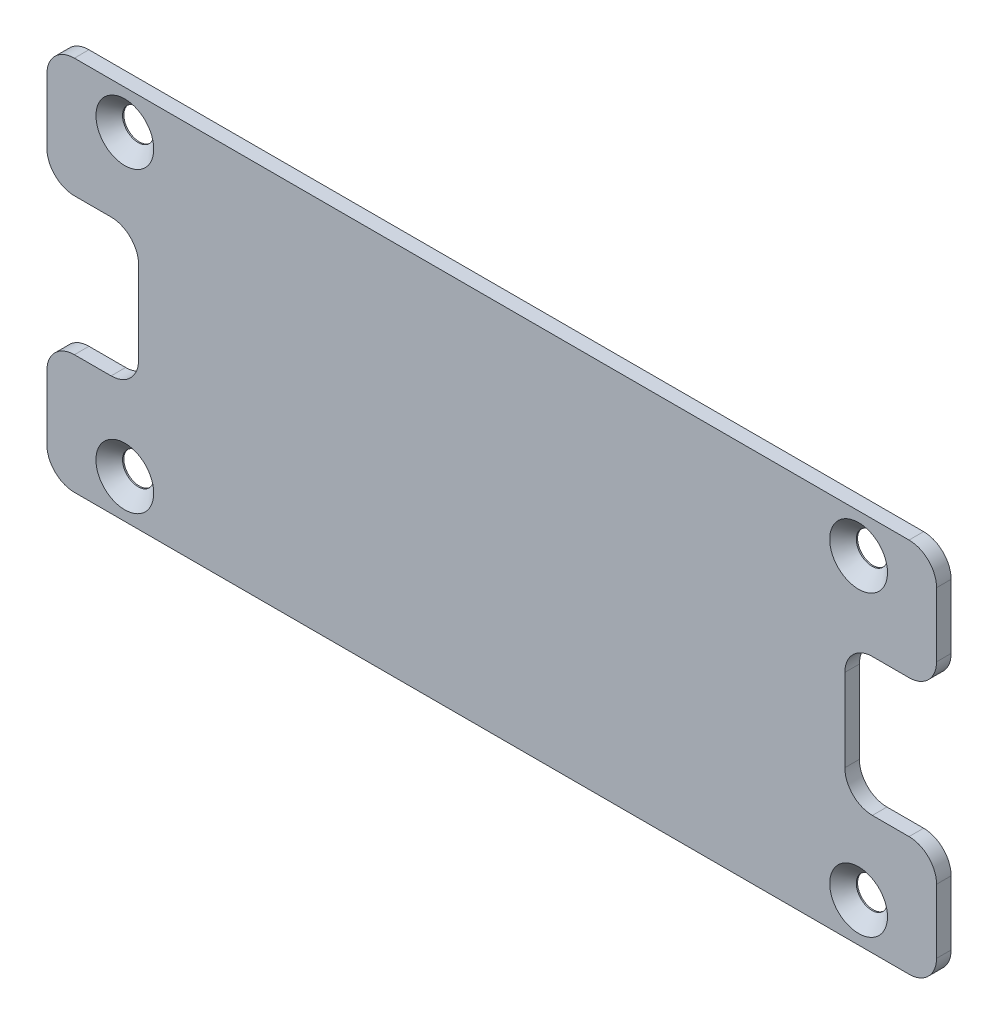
from build123d import *

# Parameters (mm, degrees)
BOSS_EXTRUDE1_DEPTH                            = 1.5875
SKETCH2_W                                      = 10
SKETCH2_H                                      = 15
CUT_EXTRUDE1_DEPTH                             = 53.678460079
CSK_FOR_M3_FLAT_HEAD_MACHINE_SCREW1_AT_2_COUNT = 2
CSK_FOR_M3_FLAT_HEAD_MACHINE_SCREW1_AT_2_PITCH = 80
CSK_FOR_M3_FLAT_HEAD_MACHINE_SCREW1_AT_3_COUNT = 2
CSK_FOR_M3_FLAT_HEAD_MACHINE_SCREW1_AT_3_PITCH = 86.349580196
CSK_FOR_M3_FLAT_HEAD_MACHINE_SCREW1_AT_4_COUNT = 2
CSK_FOR_M3_FLAT_HEAD_MACHINE_SCREW1_AT_4_PITCH = 32.5
FILLET1_R                                      = 3


with BuildPart() as part:
    # Sketch1 → Boss-Extrude1 (new body)
    with BuildSketch(Plane.XY):
        with BuildLine():
            Line((48.5, -17.5), (48.5, 17.5))
            ThreePointArc((48.5, 17.5), (47.621320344, 19.621320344), (45.5, 20.5))
            Line((45.5, 20.5), (-45.5, 20.5))
            ThreePointArc((-45.5, 20.5), (-47.621320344, 19.621320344), (-48.5, 17.5))
            Line((-48.5, 17.5), (-48.5, -17.5))
            ThreePointArc((-48.5, -17.5), (-47.621320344, -19.621320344), (-45.5, -20.5))
            Line((-45.5, -20.5), (45.5, -20.5))
            ThreePointArc((45.5, -20.5), (47.621320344, -19.621320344), (48.5, -17.5))
        make_face()
    extrude(amount=BOSS_EXTRUDE1_DEPTH)

    # Sketch2 → Cut-Extrude1 (cut, through all)
    with BuildSketch(Plane.XY.offset(1.5875)):
        with Locations((-43.5, 0)):
            Rectangle(SKETCH2_W, SKETCH2_H)
        with Locations((43.5, 0)):
            Rectangle(SKETCH2_W, SKETCH2_H)
    extrude(amount=-CUT_EXTRUDE1_DEPTH, mode=Mode.SUBTRACT)

    # Sketch3 → CSK for M3 Flat Head Machine Screw1 (revolve, cut)
    with BuildSketch(Plane(origin=(-40, 16.25, 1.5875), x_dir=(0, -1, 0), z_dir=(1, 0, 0))):
        Polygon((0, 0), (0, 1.5875), (1.7, 1.5875), (1.7, 1.45), (3.15, 0), align=None)
    csk_for_m3_flat_head_machine_screw1 = revolve(axis=Axis((-40, 16.25, 7.9375), (0, 0, -1)), mode=Mode.SUBTRACT)

    # CSK for M3 Flat Head Machine Screw1 at 2: CSK for M3 Flat Head Machine Screw1 ×2
    with Locations(*[(i * CSK_FOR_M3_FLAT_HEAD_MACHINE_SCREW1_AT_2_PITCH, 0, 0) for i in range(1, CSK_FOR_M3_FLAT_HEAD_MACHINE_SCREW1_AT_2_COUNT)]):
        add(csk_for_m3_flat_head_machine_screw1, mode=Mode.SUBTRACT)

    # CSK for M3 Flat Head Machine Screw1 at 3: CSK for M3 Flat Head Machine Screw1 ×2
    with Locations(*[Vector(0.9264665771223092, -0.37637704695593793, 0) * (i * CSK_FOR_M3_FLAT_HEAD_MACHINE_SCREW1_AT_3_PITCH) for i in range(1, CSK_FOR_M3_FLAT_HEAD_MACHINE_SCREW1_AT_3_COUNT)]):
        add(csk_for_m3_flat_head_machine_screw1, mode=Mode.SUBTRACT)

    # CSK for M3 Flat Head Machine Screw1 at 4: CSK for M3 Flat Head Machine Screw1 ×2
    with Locations(*[(0, -i * CSK_FOR_M3_FLAT_HEAD_MACHINE_SCREW1_AT_4_PITCH, 0) for i in range(1, CSK_FOR_M3_FLAT_HEAD_MACHINE_SCREW1_AT_4_COUNT)]):
        add(csk_for_m3_flat_head_machine_screw1, mode=Mode.SUBTRACT)

    # Fillet1
    fillet1_edges = [part.edges().sort_by_distance(p)[0] for p in [
        (-48.5, -7.5, 0.79375),
        (-48.5, 7.5, 0.79375),
        (-38.5, 7.5, 0.79375),
        (-38.5, -7.5, 0.79375),
        (38.5, 7.5, 0.79375),
        (48.5, 7.5, 0.79375),
        (48.5, -7.5, 0.79375),
        (38.5, -7.5, 0.79375),
    ]]
    fillet(fillet1_edges, radius=FILLET1_R)


solid = part.part
